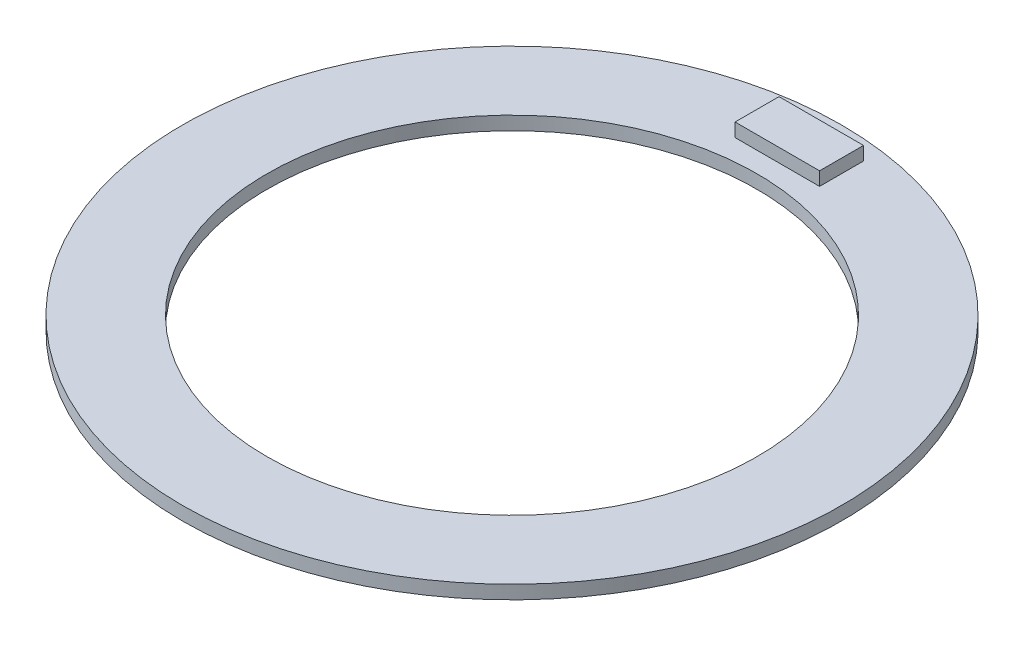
ISO-10303-21;
HEADER;
FILE_DESCRIPTION(('STEP AP214'),'2;1');
FILE_NAME('part.step','',(''),(''),'','','');
FILE_SCHEMA(('AUTOMOTIVE_DESIGN { 1 0 10303 214 1 1 1 1 }'));
ENDSEC;
DATA;
#1=APPLICATION_CONTEXT('core data for automotive mechanical design processes');
#2=APPLICATION_PROTOCOL_DEFINITION('international standard','automotive_design',2000,#1);
#3=PRODUCT_CONTEXT('',#1,'mechanical');
#4=PRODUCT('Part','Part','',(#3));
#5=PRODUCT_RELATED_PRODUCT_CATEGORY('part','',(#4));
#6=PRODUCT_DEFINITION_FORMATION('','',#4);
#7=PRODUCT_DEFINITION_CONTEXT('part definition',#1,'design');
#8=PRODUCT_DEFINITION('design','',#6,#7);
#9=PRODUCT_DEFINITION_SHAPE('','',#8);
#10=(LENGTH_UNIT() NAMED_UNIT(*) SI_UNIT(.MILLI.,.METRE.));
#11=(NAMED_UNIT(*) PLANE_ANGLE_UNIT() SI_UNIT($,.RADIAN.));
#12=(NAMED_UNIT(*) SI_UNIT($,.STERADIAN.) SOLID_ANGLE_UNIT());
#13=UNCERTAINTY_MEASURE_WITH_UNIT(LENGTH_MEASURE(1.E-05),#10,'distance_accuracy_value','');
#14=(GEOMETRIC_REPRESENTATION_CONTEXT(3) GLOBAL_UNCERTAINTY_ASSIGNED_CONTEXT((#13)) GLOBAL_UNIT_ASSIGNED_CONTEXT((#10,
#11,#12)) REPRESENTATION_CONTEXT('',''));
#15=CARTESIAN_POINT('',(0.,0.,0.));
#16=DIRECTION('',(0.,0.,1.));
#17=DIRECTION('',(1.,0.,0.));
#18=AXIS2_PLACEMENT_3D('',#15,#16,#17);
#19=CARTESIAN_POINT('',(-3.175,2.032,-23.241));
#20=DIRECTION('',(1.,0.,0.));
#21=DIRECTION('',(0.,0.,-1.));
#22=AXIS2_PLACEMENT_3D('',#19,#20,#21);
#23=PLANE('',#22);
#24=DIRECTION('',(0.,0.,1.));
#25=VECTOR('',#24,1.);
#26=CARTESIAN_POINT('',(-3.175,1.016,-23.241));
#27=LINE('',#26,#25);
#28=CARTESIAN_POINT('',(-3.175,1.016,-23.241));
#29=VERTEX_POINT('',#28);
#30=CARTESIAN_POINT('',(-3.175,1.016,-19.939));
#31=VERTEX_POINT('',#30);
#32=EDGE_CURVE('E116',#29,#31,#27,.T.);
#33=ORIENTED_EDGE('',*,*,#32,.T.);
#34=DIRECTION('',(0.,-1.,0.));
#35=VECTOR('',#34,1.);
#36=CARTESIAN_POINT('',(-3.175,2.032,-19.939));
#37=LINE('',#36,#35);
#38=CARTESIAN_POINT('',(-3.175,2.032,-19.939));
#39=VERTEX_POINT('',#38);
#40=EDGE_CURVE('E12',#39,#31,#37,.T.);
#41=ORIENTED_EDGE('',*,*,#40,.F.);
#42=DIRECTION('',(0.,0.,1.));
#43=VECTOR('',#42,1.);
#44=CARTESIAN_POINT('',(-3.175,2.032,-23.241));
#45=LINE('',#44,#43);
#46=CARTESIAN_POINT('',(-3.175,2.032,-23.241));
#47=VERTEX_POINT('',#46);
#48=EDGE_CURVE('E104',#47,#39,#45,.T.);
#49=ORIENTED_EDGE('',*,*,#48,.F.);
#50=DIRECTION('',(0.,-1.,0.));
#51=VECTOR('',#50,1.);
#52=CARTESIAN_POINT('',(-3.175,2.032,-23.241));
#53=LINE('',#52,#51);
#54=EDGE_CURVE('E112',#47,#29,#53,.T.);
#55=ORIENTED_EDGE('',*,*,#54,.T.);
#56=EDGE_LOOP('',(#33,#41,#49,#55));
#57=FACE_BOUND('',#56,.T.);
#58=ADVANCED_FACE('F53',(#57),#23,.F.);
#59=CARTESIAN_POINT('',(-3.175,2.032,-19.939));
#60=DIRECTION('',(0.,0.,-1.));
#61=DIRECTION('',(-1.,0.,0.));
#62=AXIS2_PLACEMENT_3D('',#59,#60,#61);
#63=PLANE('',#62);
#64=DIRECTION('',(1.,0.,0.));
#65=VECTOR('',#64,1.);
#66=CARTESIAN_POINT('',(-3.175,1.016,-19.939));
#67=LINE('',#66,#65);
#68=CARTESIAN_POINT('',(3.175,1.016,-19.939));
#69=VERTEX_POINT('',#68);
#70=EDGE_CURVE('E108',#31,#69,#67,.T.);
#71=ORIENTED_EDGE('',*,*,#70,.T.);
#72=DIRECTION('',(0.,-1.,0.));
#73=VECTOR('',#72,1.);
#74=CARTESIAN_POINT('',(3.175,2.032,-19.939));
#75=LINE('',#74,#73);
#76=CARTESIAN_POINT('',(3.175,2.032,-19.939));
#77=VERTEX_POINT('',#76);
#78=EDGE_CURVE('E61',#77,#69,#75,.T.);
#79=ORIENTED_EDGE('',*,*,#78,.F.);
#80=DIRECTION('',(1.,0.,0.));
#81=VECTOR('',#80,1.);
#82=CARTESIAN_POINT('',(-3.175,2.032,-19.939));
#83=LINE('',#82,#81);
#84=EDGE_CURVE('E99',#39,#77,#83,.T.);
#85=ORIENTED_EDGE('',*,*,#84,.F.);
#86=ORIENTED_EDGE('',*,*,#40,.T.);
#87=EDGE_LOOP('',(#71,#79,#85,#86));
#88=FACE_BOUND('',#87,.T.);
#89=ADVANCED_FACE('F107',(#88),#63,.F.);
#90=CARTESIAN_POINT('',(3.175,2.032,-23.241));
#91=DIRECTION('',(-1.,0.,0.));
#92=DIRECTION('',(0.,0.,1.));
#93=AXIS2_PLACEMENT_3D('',#90,#91,#92);
#94=PLANE('',#93);
#95=DIRECTION('',(0.,0.,-1.));
#96=VECTOR('',#95,1.);
#97=CARTESIAN_POINT('',(3.175,1.016,-23.241));
#98=LINE('',#97,#96);
#99=CARTESIAN_POINT('',(3.175,1.016,-23.241));
#100=VERTEX_POINT('',#99);
#101=EDGE_CURVE('E86',#69,#100,#98,.T.);
#102=ORIENTED_EDGE('',*,*,#101,.T.);
#103=DIRECTION('',(0.,-1.,0.));
#104=VECTOR('',#103,1.);
#105=CARTESIAN_POINT('',(3.175,2.032,-23.241));
#106=LINE('',#105,#104);
#107=CARTESIAN_POINT('',(3.175,2.032,-23.241));
#108=VERTEX_POINT('',#107);
#109=EDGE_CURVE('E109',#108,#100,#106,.T.);
#110=ORIENTED_EDGE('',*,*,#109,.F.);
#111=DIRECTION('',(0.,0.,-1.));
#112=VECTOR('',#111,1.);
#113=CARTESIAN_POINT('',(3.175,2.032,-23.241));
#114=LINE('',#113,#112);
#115=EDGE_CURVE('E102',#77,#108,#114,.T.);
#116=ORIENTED_EDGE('',*,*,#115,.F.);
#117=ORIENTED_EDGE('',*,*,#78,.T.);
#118=EDGE_LOOP('',(#102,#110,#116,#117));
#119=FACE_BOUND('',#118,.T.);
#120=ADVANCED_FACE('F110',(#119),#94,.F.);
#121=CARTESIAN_POINT('',(-3.175,2.032,-23.241));
#122=DIRECTION('',(0.,0.,1.));
#123=DIRECTION('',(1.,0.,0.));
#124=AXIS2_PLACEMENT_3D('',#121,#122,#123);
#125=PLANE('',#124);
#126=DIRECTION('',(-1.,0.,0.));
#127=VECTOR('',#126,1.);
#128=CARTESIAN_POINT('',(-3.175,1.016,-23.241));
#129=LINE('',#128,#127);
#130=EDGE_CURVE('E92',#100,#29,#129,.T.);
#131=ORIENTED_EDGE('',*,*,#130,.T.);
#132=ORIENTED_EDGE('',*,*,#54,.F.);
#133=DIRECTION('',(-1.,0.,0.));
#134=VECTOR('',#133,1.);
#135=CARTESIAN_POINT('',(-3.175,2.032,-23.241));
#136=LINE('',#135,#134);
#137=EDGE_CURVE('E69',#108,#47,#136,.T.);
#138=ORIENTED_EDGE('',*,*,#137,.F.);
#139=ORIENTED_EDGE('',*,*,#109,.T.);
#140=EDGE_LOOP('',(#131,#132,#138,#139));
#141=FACE_BOUND('',#140,.T.);
#142=ADVANCED_FACE('F123',(#141),#125,.F.);
#143=CARTESIAN_POINT('',(0.,2.032,0.));
#144=DIRECTION('',(0.,1.,0.));
#145=DIRECTION('',(0.,0.,1.));
#146=AXIS2_PLACEMENT_3D('',#143,#144,#145);
#147=PLANE('',#146);
#148=ORIENTED_EDGE('',*,*,#48,.T.);
#149=ORIENTED_EDGE('',*,*,#84,.T.);
#150=ORIENTED_EDGE('',*,*,#115,.T.);
#151=ORIENTED_EDGE('',*,*,#137,.T.);
#152=EDGE_LOOP('',(#148,#149,#150,#151));
#153=FACE_BOUND('',#152,.T.);
#154=ADVANCED_FACE('F100',(#153),#147,.T.);
#155=CARTESIAN_POINT('',(0.,1.016,0.));
#156=DIRECTION('',(0.,1.,0.));
#157=DIRECTION('',(0.,0.,1.));
#158=AXIS2_PLACEMENT_3D('',#155,#156,#157);
#159=PLANE('',#158);
#160=ORIENTED_EDGE('',*,*,#32,.F.);
#161=ORIENTED_EDGE('',*,*,#130,.F.);
#162=ORIENTED_EDGE('',*,*,#101,.F.);
#163=ORIENTED_EDGE('',*,*,#70,.F.);
#164=EDGE_LOOP('',(#160,#161,#162,#163));
#165=FACE_BOUND('',#164,.T.);
#166=ADVANCED_FACE('F126',(#165),#159,.F.);
#167=CLOSED_SHELL('',(#58,#89,#120,#142,#154,#166));
#168=MANIFOLD_SOLID_BREP('B2',#167);
#169=CARTESIAN_POINT('',(0.,1.016,0.));
#170=DIRECTION('',(0.,1.,0.));
#171=DIRECTION('',(0.,0.,1.));
#172=AXIS2_PLACEMENT_3D('',#169,#170,#171);
#173=PLANE('',#172);
#174=CARTESIAN_POINT('',(0.,1.016,0.));
#175=DIRECTION('',(0.,1.,0.));
#176=DIRECTION('',(0.,0.,1.));
#177=AXIS2_PLACEMENT_3D('',#174,#175,#176);
#178=CIRCLE('',#177,24.765);
#179=CARTESIAN_POINT('',(0.,1.016,24.765));
#180=VERTEX_POINT('',#179);
#181=EDGE_CURVE('E52',#180,#180,#178,.T.);
#182=ORIENTED_EDGE('',*,*,#181,.T.);
#183=EDGE_LOOP('',(#182));
#184=FACE_BOUND('',#183,.T.);
#185=CARTESIAN_POINT('',(0.,1.016,0.));
#186=DIRECTION('',(0.,1.,0.));
#187=DIRECTION('',(0.,0.,1.));
#188=AXIS2_PLACEMENT_3D('',#185,#186,#187);
#189=CIRCLE('',#188,18.415);
#190=CARTESIAN_POINT('',(0.,1.016,18.415));
#191=VERTEX_POINT('',#190);
#192=EDGE_CURVE('E200',#191,#191,#189,.T.);
#193=ORIENTED_EDGE('',*,*,#192,.F.);
#194=EDGE_LOOP('',(#193));
#195=FACE_BOUND('',#194,.T.);
#196=ADVANCED_FACE('F189',(#184,#195),#173,.T.);
#197=CARTESIAN_POINT('',(0.,0.,0.));
#198=DIRECTION('',(0.,1.,0.));
#199=DIRECTION('',(0.,0.,1.));
#200=AXIS2_PLACEMENT_3D('',#197,#198,#199);
#201=PLANE('',#200);
#202=CARTESIAN_POINT('',(0.,0.,0.));
#203=DIRECTION('',(0.,1.,0.));
#204=DIRECTION('',(0.,0.,1.));
#205=AXIS2_PLACEMENT_3D('',#202,#203,#204);
#206=CIRCLE('',#205,24.765);
#207=CARTESIAN_POINT('',(0.,0.,24.765));
#208=VERTEX_POINT('',#207);
#209=EDGE_CURVE('E193',#208,#208,#206,.T.);
#210=ORIENTED_EDGE('',*,*,#209,.F.);
#211=EDGE_LOOP('',(#210));
#212=FACE_BOUND('',#211,.T.);
#213=CARTESIAN_POINT('',(0.,0.,0.));
#214=DIRECTION('',(0.,1.,0.));
#215=DIRECTION('',(0.,0.,1.));
#216=AXIS2_PLACEMENT_3D('',#213,#214,#215);
#217=CIRCLE('',#216,18.415);
#218=CARTESIAN_POINT('',(0.,0.,18.415));
#219=VERTEX_POINT('',#218);
#220=EDGE_CURVE('E202',#219,#219,#217,.T.);
#221=ORIENTED_EDGE('',*,*,#220,.T.);
#222=EDGE_LOOP('',(#221));
#223=FACE_BOUND('',#222,.T.);
#224=ADVANCED_FACE('F212',(#212,#223),#201,.F.);
#225=CARTESIAN_POINT('',(0.,1.016,0.));
#226=DIRECTION('',(0.,-1.,0.));
#227=DIRECTION('',(0.,0.,-1.));
#228=AXIS2_PLACEMENT_3D('',#225,#226,#227);
#229=CYLINDRICAL_SURFACE('',#228,24.765);
#230=ORIENTED_EDGE('',*,*,#181,.F.);
#231=EDGE_LOOP('',(#230));
#232=FACE_BOUND('',#231,.T.);
#233=ORIENTED_EDGE('',*,*,#209,.T.);
#234=EDGE_LOOP('',(#233));
#235=FACE_BOUND('',#234,.T.);
#236=ADVANCED_FACE('F191',(#232,#235),#229,.T.);
#237=CARTESIAN_POINT('',(0.,1.016,0.));
#238=DIRECTION('',(0.,-1.,0.));
#239=DIRECTION('',(0.,0.,-1.));
#240=AXIS2_PLACEMENT_3D('',#237,#238,#239);
#241=CYLINDRICAL_SURFACE('',#240,18.415);
#242=ORIENTED_EDGE('',*,*,#192,.T.);
#243=EDGE_LOOP('',(#242));
#244=FACE_BOUND('',#243,.T.);
#245=ORIENTED_EDGE('',*,*,#220,.F.);
#246=EDGE_LOOP('',(#245));
#247=FACE_BOUND('',#246,.T.);
#248=ADVANCED_FACE('F208',(#244,#247),#241,.F.);
#249=CLOSED_SHELL('',(#196,#224,#236,#248));
#250=MANIFOLD_SOLID_BREP('B6',#249);
#251=ADVANCED_BREP_SHAPE_REPRESENTATION('',(#18,#168,#250),#14);
#252=SHAPE_DEFINITION_REPRESENTATION(#9,#251);
ENDSEC;
END-ISO-10303-21;
